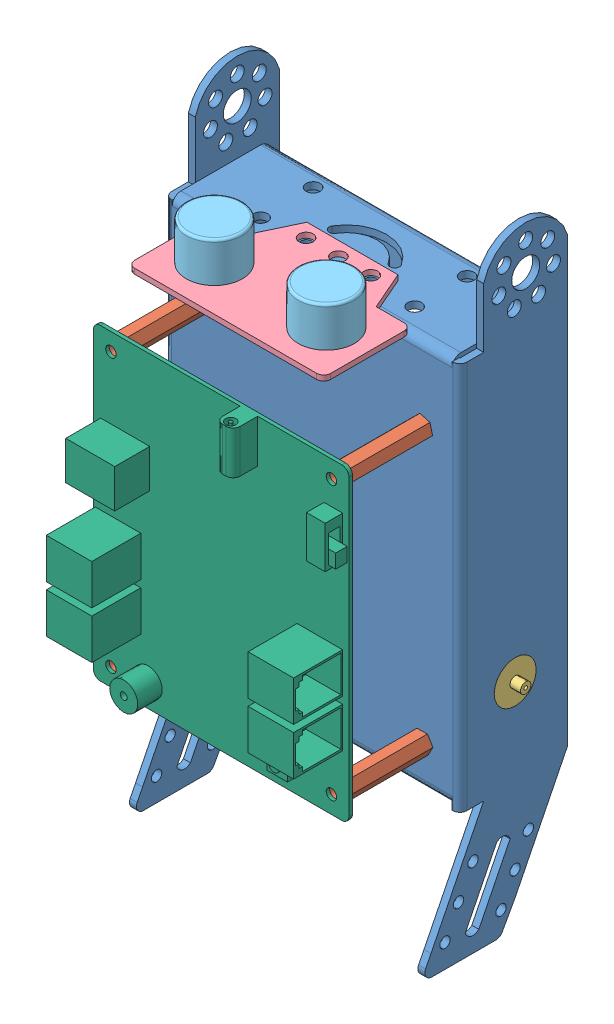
SolidWorks assembly chassis.SLDASM, configuration Défaut (file format 5000). Lengths in mm.
Overall size (90.4 173.31 70.8).
12 component instances, 6 part files, 20 mates.
Components (placement in the parent):
- BaseRobot-1: BaseRobot.SLDPRT [Défaut] at (-12.5663 -55.9072 10.3897) size (84.4 173.31 40.82)
- EntreToise-1: EntreToise.SLDPRT [Défaut] at (-40.6903 27.0928 10.3897) size (6 5.27 25)
- EntreToise-2: EntreToise.SLDPRT [Défaut] at (22.3077 27.0928 10.3897) x (0.954785 -0.297297 0) z (0 0 1) size (6 5.27 25)
- EntreToise-3: EntreToise.SLDPRT [Défaut] at (-40.6903 -50.9072 10.3897) size (6 5.27 25)
- EntreToise-4: EntreToise.SLDPRT [Défaut] at (22.3077 -50.9072 10.3897) size (6 5.27 25)
- Moto Reducteur-1: Moto Reducteur.SLDPRT [Défaut] at (21.6087 -1.8249 -5.4108) x (0 -1 0) z (1 0 0) size (69.7 22.5 23.8)
- Moto Reducteur-2: Moto Reducteur.SLDPRT [Défaut] at (-39.9913 -1.8249 -5.4108) x (0 -1 0) z (-1 0 0) size (69.7 22.5 23.8)
- CarteUltraSon-1: CarteUltraSon.SLDASM [Défaut] at (-8.1009 49.1251 16.7065) x (-1 0 0) z (0 1 0) size (56 36 12.9)
  - CarteUltraSon-1: CarteUltraSon.SLDPRT [Défaut] at (-26.9365 -6.5802 -0.75) size (56 36 1.5)
  - UltraSon-1: UltraSon.SLDPRT [Défaut] at (-14.9365 5.6707 12.15) x (-0.923728 -0.383049 0) z (0 0 -1) size (16 16 12.4)
  - UltraSon-2: UltraSon.SLDPRT [Défaut] at (17.0635 5.6707 12.15) x (-0.923728 -0.383049 0) z (0 0 -1) size (16 16 12.4)
- CarteMere-1: CarteMere.SLDPRT [Défaut] at (27.3077 -55.9072 36.3897) x (-1 0 0) z (0 0 -1) size (73.21 88 15)
Mates (geometry in assembly coordinates):
- Coaxiale1: concentric anti-aligned: cylinder of BaseRobot-1 through (-40.6903 27.0928 10.3897) axis (0 0 1) radius 2.5; cylinder of EntreToise-1 through (-40.6903 27.0928 35.3897) axis (0 0 -1) radius 1.5
- Coïncidente1: coincident anti-aligned: plane of BaseRobot-1 through (-39.3698 -97.7695 10.3897) normal (0 0 1); plane of EntreToise-1 through (-40.6903 27.0928 10.3897) normal (0 0 -1)
- Coaxiale2: concentric anti-aligned: cylinder of BaseRobot-1 through (22.3077 27.0928 10.3897) axis (0 0 1) radius 2.5; cylinder of EntreToise-2 through (22.3077 27.0928 35.3897) axis (0 0 -1) radius 1.5
- Coïncidente2: coincident anti-aligned: plane of BaseRobot-1 through (-39.3698 -97.7695 10.3897) normal (0 0 1); plane of EntreToise-2 through (22.3077 27.0928 10.3897) normal (0 0 -1)
- Coaxiale3: concentric anti-aligned: cylinder of BaseRobot-1 through (-40.6903 -50.9072 10.3897) axis (0 0 1) radius 2.5; cylinder of EntreToise-3 through (-40.6903 -50.9072 35.3897) axis (0 0 -1) radius 1.5
- Coïncidente3: coincident anti-aligned: plane of BaseRobot-1 through (-39.3698 -97.7695 10.3897) normal (0 0 1); plane of EntreToise-3 through (-40.6903 -50.9072 10.3897) normal (0 0 -1)
- Coaxiale4: concentric anti-aligned: cylinder of BaseRobot-1 through (22.3077 -50.9072 10.3897) axis (0 0 1) radius 2.5; cylinder of EntreToise-4 through (22.3077 -50.9072 35.3897) axis (0 0 -1) radius 1.5
- Coïncidente4: coincident anti-aligned: plane of BaseRobot-1 through (-39.3698 -97.7695 10.3897) normal (0 0 1); plane of EntreToise-4 through (22.3077 -50.9072 10.3897) normal (0 0 -1)
- Coaxiale5: concentric anti-aligned: cylinder of BaseRobot-1 through (33.0087 -38.6249 -5.4108) axis (1 0 0) radius 6; cylinder of Moto Reducteur-1 through (33.0087 -38.6249 -5.4108) axis (-1 0 0) radius 6
- Coïncidente5: coincident anti-aligned: plane of BaseRobot-1 through (31.0087 61.1023 -8.4108) normal (-1 0 0); plane of Moto Reducteur-1 through (31.0087 -47.5249 3.5392) normal (1 0 0)
- Parallèle1: parallel anti-aligned: plane of BaseRobot-1 through (-39.3698 -97.7695 8.3897) normal (0 0 -1); plane of Moto Reducteur-1 through (31.0087 -47.5249 5.8392) normal (0 0 1)
- Coaxiale6: concentric anti-aligned: cylinder of BaseRobot-1 through (-51.3913 -38.6249 -5.4108) axis (-1 0 0) radius 6; cylinder of Moto Reducteur-2 through (-51.3913 -38.6249 -5.4108) axis (1 0 0) radius 6
- Coïncidente7: coincident anti-aligned: plane of BaseRobot-1 through (-49.3913 -97.7695 18.4108) normal (1 0 0); plane of Moto Reducteur-2 through (-49.3913 -47.5249 -14.3608) normal (-1 0 0)
- Parallèle2: parallel anti-aligned: plane of BaseRobot-1 through (-39.3698 -97.7695 8.3897) normal (0 0 -1); plane of Moto Reducteur-2 through (-49.3913 -47.5249 5.8392) normal (0 0 1)
- Coïncidente9: coincident anti-aligned: plane of BaseRobot-1 through (-12.5663 48.3751 10.3897) normal (0 1 0); plane of CarteUltraSon-1/CarteUltraSon-1 through (18.8356 48.3751 10.1263) normal (0 -1 0)
- Coaxiale7: concentric aligned: cylinder of BaseRobot-1 through (0.294 48.3751 3.1263) axis (0 1 0) radius 1.5; cylinder of CarteUltraSon-1/CarteUltraSon-1 through (0.294 49.8751 3.1263) axis (0 1 0) radius 2
- Coaxiale8: concentric aligned: cylinder of BaseRobot-1 through (-18.206 48.3751 3.1263) axis (0 1 0) radius 1.5; cylinder of CarteUltraSon-1/CarteUltraSon-1 through (-18.206 49.8751 3.1263) axis (0 1 0) radius 2
- Coïncidente11: coincident anti-aligned: plane of EntreToise-3 through (-40.6903 -50.9072 35.3897) normal (0 0 1); plane of CarteMere-1 through (27.3077 -55.9072 35.3897) normal (0 0 -1)
- Coaxiale9: concentric aligned: cylinder of EntreToise-4 through (22.3077 -50.9072 35.3897) axis (0 0 -1) radius 1.5; cylinder of CarteMere-1 through (22.3077 -50.9072 35.3897) axis (0 0 -1) radius 1.5
- Coaxiale10: concentric aligned: cylinder of EntreToise-2 through (22.3077 27.0928 35.3897) axis (0 0 -1) radius 1.5; cylinder of CarteMere-1 through (22.3077 27.0928 35.3897) axis (0 0 -1) radius 1.5
